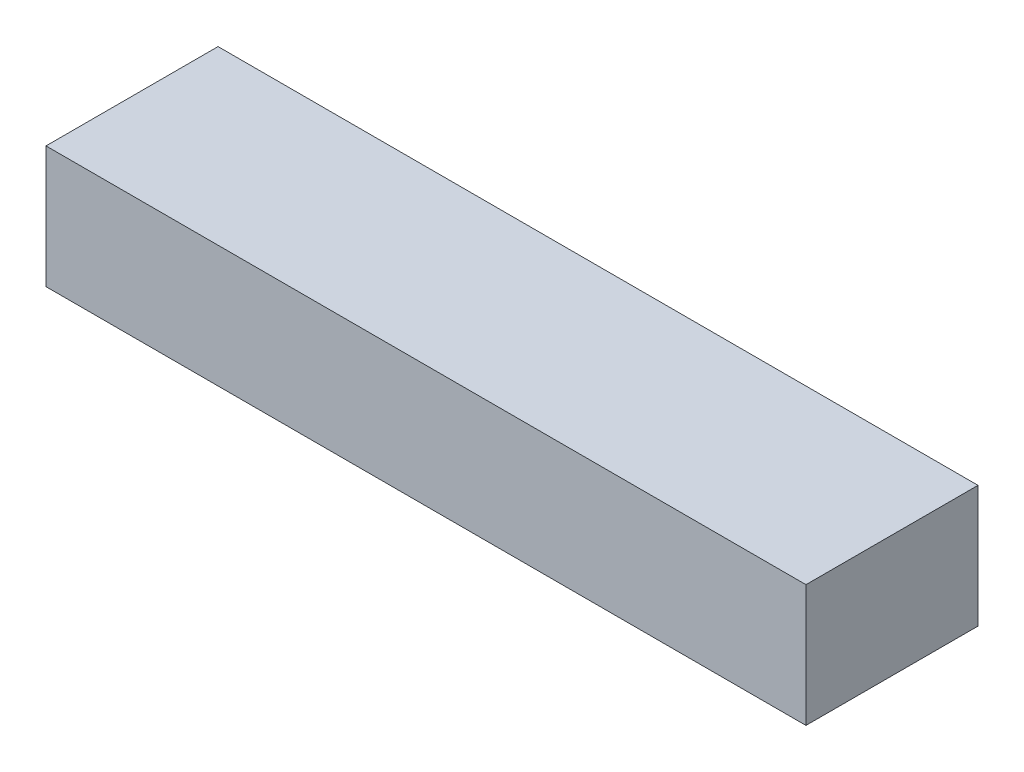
from build123d import *

# Parameters (mm, degrees)
SKETCH1_W           = 28.05
SKETCH1_H           = 4.5
BOSS_EXTRUDE1_DEPTH = 6.35


with BuildPart() as part:
    # Sketch1 → Boss-Extrude1 (new body)
    with BuildSketch(Plane.XY):
        with Locations((14.025, 2.25)):
            Rectangle(SKETCH1_W, SKETCH1_H)
    extrude(amount=BOSS_EXTRUDE1_DEPTH)


solid = part.part
